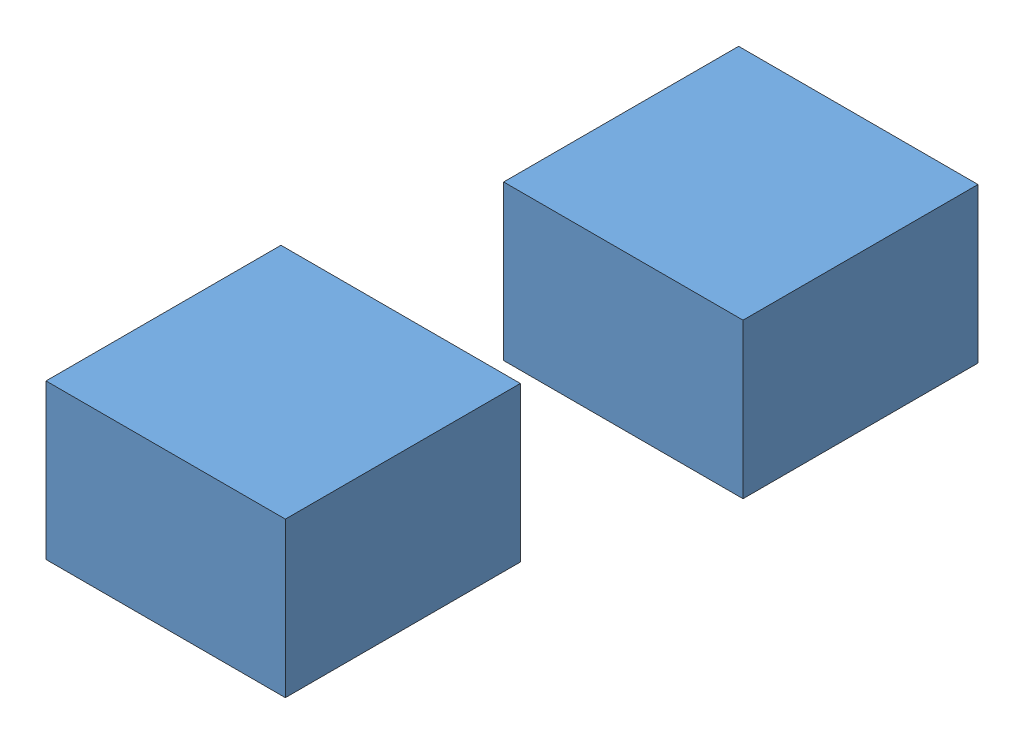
SolidWorks assembly Assem2.SLDASM, configuration Default (file format 3684). Lengths in mm.
Overall size (146.97 107.28 114.97).
2 component instances, 1 part files, 0 mates.
Components (placement in the parent):
- Block1-1: Block1.SLDPRT [Config1] at (-29.5136 -19.8584 -36.472) size (67.27 43.47 66.04)
- Block1-2: Block1.SLDPRT [Config2] at (50.1806 43.9495 -85.4044) size (67.27 43.47 66.04)
